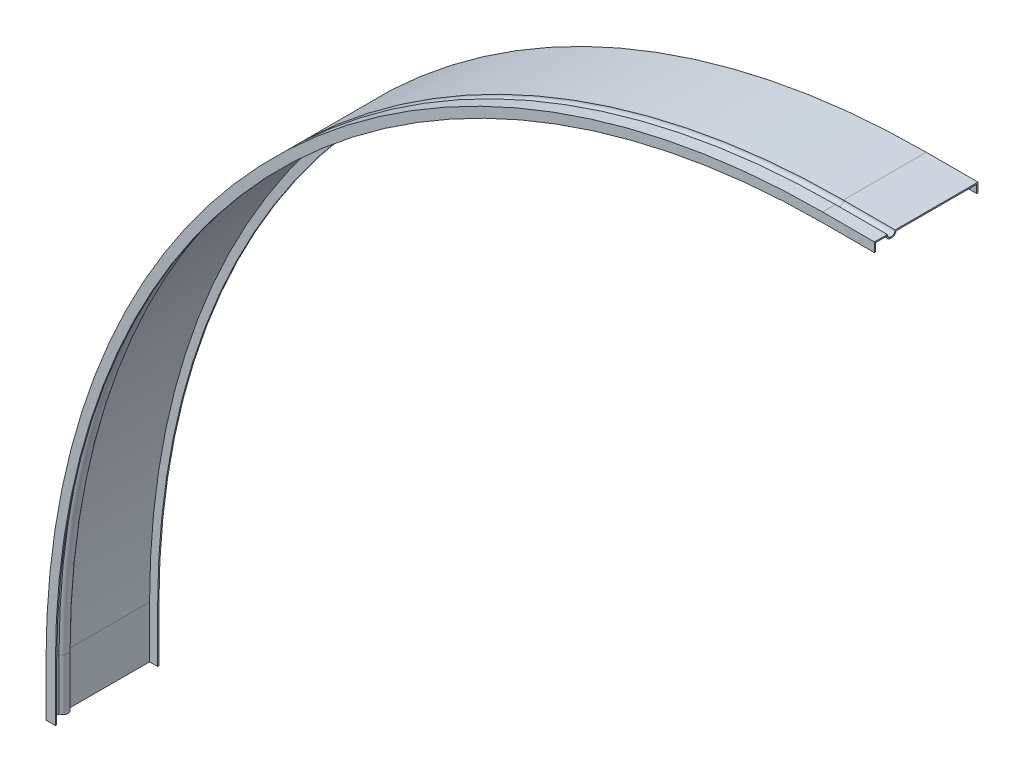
from build123d import *


with BuildPart() as part:
    # Sweep1: sweep along a path in Sketch1
    with BuildLine(Plane.XY) as sweep1_path:
        Line((0, 0), (0, 50))
        ThreePointArc((0, 50), (219.66991411, 580.33008589), (750, 800))
        Line((750, 800), (800, 800))
    # Sketch2 → Sweep1 (sweep)
    with BuildSketch(Plane(origin=(0, 0, 0), x_dir=(1, 0, 0), z_dir=(0, 1, 0))):
        with BuildLine():
            Line((0, 0), (9, 0))
            Line((9, 0), (9, -1.214))
            Line((9, -1.214), (1.214, -1.214))
            Line((1.214, -1.214), (1.214, -78.935618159))
            ThreePointArc((1.214, -78.935618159), (5, -83.786), (1.214, -88.636381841))
            Line((1.214, -88.636381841), (1.214, -98.786))
            Line((1.214, -98.786), (9, -98.786))
            Line((9, -98.786), (9, -100))
            Line((9, -100), (0, -100))
            Line((0, -100), (0, -87.572))
            ThreePointArc((0, -87.572), (3.786, -83.786), (0, -80))
            Line((0, -80), (0, 0))
        make_face()
    sweep(path=sweep1_path.line)


solid = part.part
